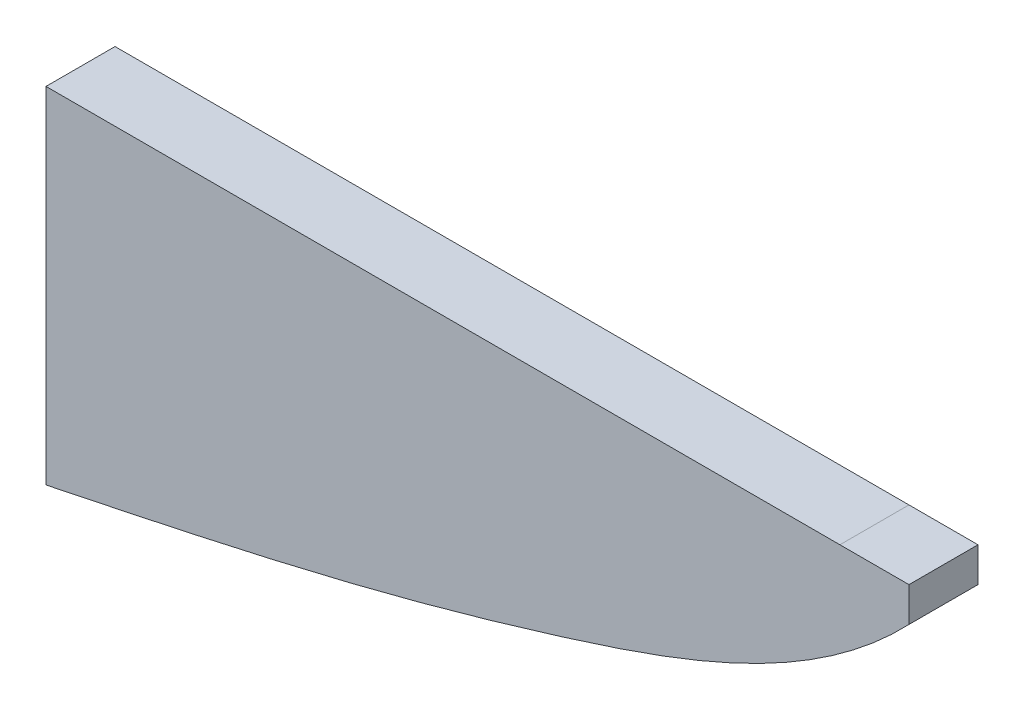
ISO-10303-21;
HEADER;
FILE_DESCRIPTION(('STEP AP214'),'2;1');
FILE_NAME('part.step','',(''),(''),'','','');
FILE_SCHEMA(('AUTOMOTIVE_DESIGN { 1 0 10303 214 1 1 1 1 }'));
ENDSEC;
DATA;
#1=APPLICATION_CONTEXT('core data for automotive mechanical design processes');
#2=APPLICATION_PROTOCOL_DEFINITION('international standard','automotive_design',2000,#1);
#3=PRODUCT_CONTEXT('',#1,'mechanical');
#4=PRODUCT('Part','Part','',(#3));
#5=PRODUCT_RELATED_PRODUCT_CATEGORY('part','',(#4));
#6=PRODUCT_DEFINITION_FORMATION('','',#4);
#7=PRODUCT_DEFINITION_CONTEXT('part definition',#1,'design');
#8=PRODUCT_DEFINITION('design','',#6,#7);
#9=PRODUCT_DEFINITION_SHAPE('','',#8);
#10=(LENGTH_UNIT() NAMED_UNIT(*) SI_UNIT(.MILLI.,.METRE.));
#11=(NAMED_UNIT(*) PLANE_ANGLE_UNIT() SI_UNIT($,.RADIAN.));
#12=(NAMED_UNIT(*) SI_UNIT($,.STERADIAN.) SOLID_ANGLE_UNIT());
#13=UNCERTAINTY_MEASURE_WITH_UNIT(LENGTH_MEASURE(1.E-05),#10,'distance_accuracy_value','');
#14=(GEOMETRIC_REPRESENTATION_CONTEXT(3) GLOBAL_UNCERTAINTY_ASSIGNED_CONTEXT((#13)) GLOBAL_UNIT_ASSIGNED_CONTEXT((#10,
#11,#12)) REPRESENTATION_CONTEXT('',''));
#15=CARTESIAN_POINT('',(0.,0.,0.));
#16=DIRECTION('',(0.,0.,1.));
#17=DIRECTION('',(1.,0.,0.));
#18=AXIS2_PLACEMENT_3D('',#15,#16,#17);
#19=CARTESIAN_POINT('',(0.,50.,20.));
#20=DIRECTION('',(0.,1.,0.));
#21=DIRECTION('',(0.,0.,1.));
#22=AXIS2_PLACEMENT_3D('',#19,#20,#21);
#23=PLANE('',#22);
#24=DIRECTION('',(1.,0.,0.));
#25=VECTOR('',#24,1.);
#26=CARTESIAN_POINT('',(0.,50.,0.));
#27=LINE('',#26,#25);
#28=CARTESIAN_POINT('',(230.,50.,0.));
#29=VERTEX_POINT('',#28);
#30=CARTESIAN_POINT('',(250.,50.,0.));
#31=VERTEX_POINT('',#30);
#32=EDGE_CURVE('E125',#29,#31,#27,.T.);
#33=ORIENTED_EDGE('',*,*,#32,.F.);
#34=DIRECTION('',(0.,0.,1.));
#35=VECTOR('',#34,1.);
#36=CARTESIAN_POINT('',(230.,50.,20.));
#37=LINE('',#36,#35);
#38=CARTESIAN_POINT('',(230.,50.,20.));
#39=VERTEX_POINT('',#38);
#40=EDGE_CURVE('E11',#29,#39,#37,.T.);
#41=ORIENTED_EDGE('',*,*,#40,.T.);
#42=DIRECTION('',(1.,0.,0.));
#43=VECTOR('',#42,1.);
#44=CARTESIAN_POINT('',(0.,50.,20.));
#45=LINE('',#44,#43);
#46=CARTESIAN_POINT('',(250.,50.,20.));
#47=VERTEX_POINT('',#46);
#48=EDGE_CURVE('E107',#39,#47,#45,.T.);
#49=ORIENTED_EDGE('',*,*,#48,.T.);
#50=DIRECTION('',(0.,0.,-1.));
#51=VECTOR('',#50,1.);
#52=CARTESIAN_POINT('',(250.,50.,20.));
#53=LINE('',#52,#51);
#54=EDGE_CURVE('E103',#47,#31,#53,.T.);
#55=ORIENTED_EDGE('',*,*,#54,.T.);
#56=EDGE_LOOP('',(#33,#41,#49,#55));
#57=FACE_BOUND('',#56,.T.);
#58=ADVANCED_FACE('F40',(#57),#23,.T.);
#59=CARTESIAN_POINT('',(0.,-50.,20.));
#60=CARTESIAN_POINT('',(33.4199486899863,-43.0608583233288,20.));
#61=CARTESIAN_POINT('',(83.9632555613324,-32.5541977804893,20.));
#62=CARTESIAN_POINT('',(169.944017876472,-7.88320989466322,20.));
#63=CARTESIAN_POINT('',(222.615387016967,11.374413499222,20.));
#64=CARTESIAN_POINT('',(250.,40.,20.));
#65=B_SPLINE_CURVE_WITH_KNOTS('',3,(#59,#60,#61,#62,#63,#64),.UNSPECIFIED.,.F.,.F.,(4,1,1,4),
(0.,0.381514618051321,0.575066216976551,1.),.UNSPECIFIED.);
#66=DIRECTION('',(0.,0.,-1.));
#67=VECTOR('',#66,1.);
#68=SURFACE_OF_LINEAR_EXTRUSION('',#65,#67);
#69=CARTESIAN_POINT('',(0.,-50.,0.));
#70=CARTESIAN_POINT('',(33.4199486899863,-43.0608583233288,0.));
#71=CARTESIAN_POINT('',(83.9632555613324,-32.5541977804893,0.));
#72=CARTESIAN_POINT('',(169.944017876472,-7.88320989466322,0.));
#73=CARTESIAN_POINT('',(222.615387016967,11.374413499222,0.));
#74=CARTESIAN_POINT('',(250.,40.,0.));
#75=B_SPLINE_CURVE_WITH_KNOTS('',3,(#69,#70,#71,#72,#73,#74),.UNSPECIFIED.,.F.,.F.,(4,1,1,4),
(0.,0.381514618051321,0.575066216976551,1.),.UNSPECIFIED.);
#76=CARTESIAN_POINT('',(0.,-50.,0.));
#77=VERTEX_POINT('',#76);
#78=CARTESIAN_POINT('',(250.,40.,0.));
#79=VERTEX_POINT('',#78);
#80=EDGE_CURVE('E99',#77,#79,#75,.T.);
#81=ORIENTED_EDGE('',*,*,#80,.T.);
#82=DIRECTION('',(0.,0.,-1.));
#83=VECTOR('',#82,1.);
#84=CARTESIAN_POINT('',(250.,40.,20.));
#85=LINE('',#84,#83);
#86=CARTESIAN_POINT('',(250.,40.,20.));
#87=VERTEX_POINT('',#86);
#88=EDGE_CURVE('E50',#87,#79,#85,.T.);
#89=ORIENTED_EDGE('',*,*,#88,.F.);
#90=CARTESIAN_POINT('',(0.,-50.,20.));
#91=VERTEX_POINT('',#90);
#92=EDGE_CURVE('E87',#91,#87,#65,.T.);
#93=ORIENTED_EDGE('',*,*,#92,.F.);
#94=DIRECTION('',(0.,0.,-1.));
#95=VECTOR('',#94,1.);
#96=CARTESIAN_POINT('',(0.,-50.,20.));
#97=LINE('',#96,#95);
#98=EDGE_CURVE('E116',#91,#77,#97,.T.);
#99=ORIENTED_EDGE('',*,*,#98,.T.);
#100=EDGE_LOOP('',(#81,#89,#93,#99));
#101=FACE_BOUND('',#100,.T.);
#102=ADVANCED_FACE('F42',(#101),#68,.F.);
#103=CARTESIAN_POINT('',(250.,50.,20.));
#104=DIRECTION('',(1.,0.,0.));
#105=DIRECTION('',(0.,0.,-1.));
#106=AXIS2_PLACEMENT_3D('',#103,#104,#105);
#107=PLANE('',#106);
#108=DIRECTION('',(0.,-1.,0.));
#109=VECTOR('',#108,1.);
#110=CARTESIAN_POINT('',(250.,50.,0.));
#111=LINE('',#110,#109);
#112=EDGE_CURVE('E120',#31,#79,#111,.T.);
#113=ORIENTED_EDGE('',*,*,#112,.F.);
#114=ORIENTED_EDGE('',*,*,#54,.F.);
#115=DIRECTION('',(0.,-1.,0.));
#116=VECTOR('',#115,1.);
#117=CARTESIAN_POINT('',(250.,50.,20.));
#118=LINE('',#117,#116);
#119=EDGE_CURVE('E91',#47,#87,#118,.T.);
#120=ORIENTED_EDGE('',*,*,#119,.T.);
#121=ORIENTED_EDGE('',*,*,#88,.T.);
#122=EDGE_LOOP('',(#113,#114,#120,#121));
#123=FACE_BOUND('',#122,.T.);
#124=ADVANCED_FACE('F105',(#123),#107,.T.);
#125=ORIENTED_EDGE('',*,*,#40,.F.);
#126=CARTESIAN_POINT('',(0.,50.,0.));
#127=VERTEX_POINT('',#126);
#128=EDGE_CURVE('E126',#127,#29,#27,.T.);
#129=ORIENTED_EDGE('',*,*,#128,.F.);
#130=DIRECTION('',(0.,0.,-1.));
#131=VECTOR('',#130,1.);
#132=CARTESIAN_POINT('',(0.,50.,20.));
#133=LINE('',#132,#131);
#134=CARTESIAN_POINT('',(0.,50.,20.));
#135=VERTEX_POINT('',#134);
#136=EDGE_CURVE('E132',#135,#127,#133,.T.);
#137=ORIENTED_EDGE('',*,*,#136,.F.);
#138=EDGE_CURVE('E109',#135,#39,#45,.T.);
#139=ORIENTED_EDGE('',*,*,#138,.T.);
#140=EDGE_LOOP('',(#125,#129,#137,#139));
#141=FACE_BOUND('',#140,.T.);
#142=ADVANCED_FACE('F137',(#141),#23,.T.);
#143=CARTESIAN_POINT('',(0.,-50.,20.));
#144=DIRECTION('',(-1.,0.,0.));
#145=DIRECTION('',(0.,0.,1.));
#146=AXIS2_PLACEMENT_3D('',#143,#144,#145);
#147=PLANE('',#146);
#148=DIRECTION('',(0.,1.,0.));
#149=VECTOR('',#148,1.);
#150=CARTESIAN_POINT('',(0.,-50.,0.));
#151=LINE('',#150,#149);
#152=EDGE_CURVE('E96',#77,#127,#151,.T.);
#153=ORIENTED_EDGE('',*,*,#152,.F.);
#154=ORIENTED_EDGE('',*,*,#98,.F.);
#155=DIRECTION('',(0.,1.,0.));
#156=VECTOR('',#155,1.);
#157=CARTESIAN_POINT('',(0.,-50.,20.));
#158=LINE('',#157,#156);
#159=EDGE_CURVE('E94',#91,#135,#158,.T.);
#160=ORIENTED_EDGE('',*,*,#159,.T.);
#161=ORIENTED_EDGE('',*,*,#136,.T.);
#162=EDGE_LOOP('',(#153,#154,#160,#161));
#163=FACE_BOUND('',#162,.T.);
#164=ADVANCED_FACE('F139',(#163),#147,.T.);
#165=CARTESIAN_POINT('',(130.668210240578,-19.0333420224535,20.));
#166=DIRECTION('',(0.,0.,-1.));
#167=DIRECTION('',(-1.,0.,0.));
#168=AXIS2_PLACEMENT_3D('',#165,#166,#167);
#169=PLANE('',#168);
#170=ORIENTED_EDGE('',*,*,#92,.T.);
#171=ORIENTED_EDGE('',*,*,#119,.F.);
#172=ORIENTED_EDGE('',*,*,#48,.F.);
#173=ORIENTED_EDGE('',*,*,#138,.F.);
#174=ORIENTED_EDGE('',*,*,#159,.F.);
#175=EDGE_LOOP('',(#170,#171,#172,#173,#174));
#176=FACE_BOUND('',#175,.T.);
#177=ADVANCED_FACE('F89',(#176),#169,.F.);
#178=CARTESIAN_POINT('',(130.668210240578,-19.0333420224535,0.));
#179=DIRECTION('',(0.,0.,-1.));
#180=DIRECTION('',(-1.,0.,0.));
#181=AXIS2_PLACEMENT_3D('',#178,#179,#180);
#182=PLANE('',#181);
#183=ORIENTED_EDGE('',*,*,#80,.F.);
#184=ORIENTED_EDGE('',*,*,#152,.T.);
#185=ORIENTED_EDGE('',*,*,#128,.T.);
#186=ORIENTED_EDGE('',*,*,#32,.T.);
#187=ORIENTED_EDGE('',*,*,#112,.T.);
#188=EDGE_LOOP('',(#183,#184,#185,#186,#187));
#189=FACE_BOUND('',#188,.T.);
#190=ADVANCED_FACE('F135',(#189),#182,.T.);
#191=CLOSED_SHELL('',(#58,#102,#124,#142,#164,#177,#190));
#192=MANIFOLD_SOLID_BREP('B2',#191);
#193=ADVANCED_BREP_SHAPE_REPRESENTATION('',(#18,#192),#14);
#194=SHAPE_DEFINITION_REPRESENTATION(#9,#193);
ENDSEC;
END-ISO-10303-21;
